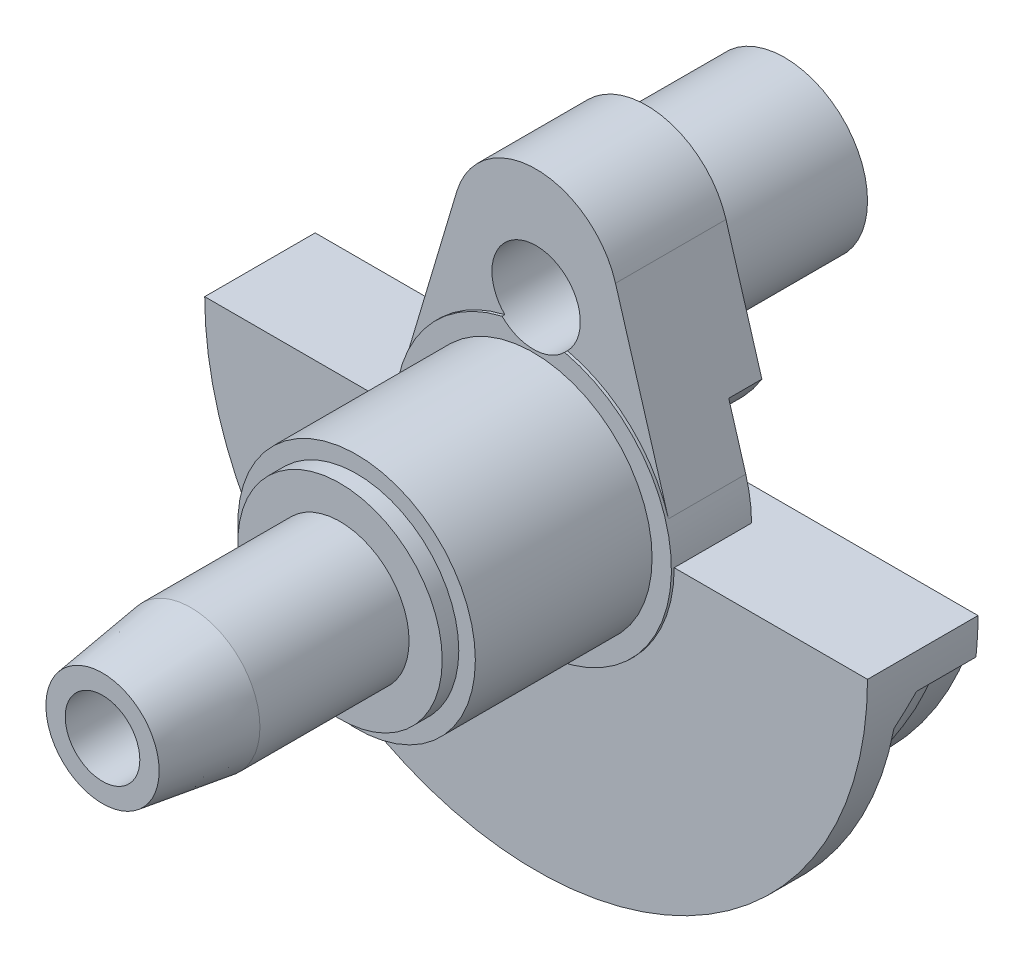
from build123d import *

# Parameters (mm, degrees)
BOSS_EXTRUDE1_DEPTH      = 1
BOSS_EXTRUDE1_DEPTH_BACK = 40
SKETCH1_R                = 50
BOSS_EXTRUDE2_DEPTH      = 40
SKETCH3_R                = 25
BOSS_EXTRUDE3_DEPTH      = 32
BOSS_EXTRUDE3_TAPER      = 8
SKETCH4_R                = 30
BOSS_EXTRUDE4_DEPTH      = 50
SKETCH5_R                = 21
CUT_EXTRUDE1_DEPTH       = 25
CUT_EXTRUDE2_REACH       = 281.435
SKETCH6_R                = 11
CUT_EXTRUDE3_START       = -41
SKETCH7_R                = 16
CUT_EXTRUDE3_DEPTH       = 41
SKETCH8_R                = 13.50269329
CUT_EXTRUDE4_DEPTH       = 30
CUT_REVOLVE1_ANGLE       = 140
CUT_EXTRUDE5_DEPTH       = 12


with BuildPart() as part:
    # Sketch1 → Boss-Extrude1 (new, two sides: drawn at the far end of the back side and taken through both)
    with BuildSketch(Plane.XY.offset(-BOSS_EXTRUDE1_DEPTH_BACK)):
        Circle(SKETCH1_R)
    extrude(amount=BOSS_EXTRUDE1_DEPTH + BOSS_EXTRUDE1_DEPTH_BACK)

    # Sketch1_3 → Boss-Extrude2 (add)
    with BuildSketch(Plane.XY):
        with BuildLine():
            ThreePointArc((50, 0), (0, -50), (-50, 0))
            Line((-50, 0), (-120, 0))
            ThreePointArc((-120, 0), (0, -120), (120, 0))
            Line((120, 0), (50, 0))
        make_face()
        with BuildLine():
            ThreePointArc((28.749445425, 78.571428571), (0, 100), (-28.749445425, 78.571428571))
            Line((-28.749445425, 78.571428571), (-47.915742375, 14.285714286))
            ThreePointArc((-47.915742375, 14.285714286), (0, 50), (47.915742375, 14.285714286))
            Line((47.915742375, 14.285714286), (28.749445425, 78.571428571))
        make_face()
    extrude(amount=-BOSS_EXTRUDE2_DEPTH)

    # Sketch2 → Revolve1 (revolve)
    with BuildSketch(Plane(origin=(0, 0, 0), x_dir=(0, 0, -1), z_dir=(1, 0, 0)), mode=Mode.PRIVATE) as revolve1_sk:
        Polygon((-1, 0), (-1, 43), (-65, 43), (-65, 37), (-71, 37), (-71, 25), (-125, 25), (-125, 0), align=None)
    revolve(revolve1_sk.sketch.rotate(Axis((0, 0, 125), (0, 0, -1)), 90), axis=Axis((0, 0, 125), (0, 0, -1)))

    # Sketch3 → Boss-Extrude3 (add)
    with BuildSketch(Plane.XY.offset(125)):
        Circle(SKETCH3_R)
    extrude(amount=BOSS_EXTRUDE3_DEPTH, taper=BOSS_EXTRUDE3_TAPER)

    # Sketch4 → Boss-Extrude4 (add)
    with BuildSketch(Plane(origin=(0, 0, -40), x_dir=(-1, 0, 0), z_dir=(0, 0, -1))):
        with Locations(Location((0, 60, 0), (0, 0, 180))):
            Circle(SKETCH4_R)
    extrude(amount=BOSS_EXTRUDE4_DEPTH)

    # Sketch5 → Cut-Extrude1 (cut)
    with BuildSketch(Plane(origin=(0, 0, -90), x_dir=(-1, 0, 0), z_dir=(0, 0, -1))):
        with Locations((0, 60)):
            Circle(SKETCH5_R)
    extrude(amount=-CUT_EXTRUDE1_DEPTH, mode=Mode.SUBTRACT)

    # Cut-Extrude2: up to this face of the body (flat: up to its plane)
    cut_extrude2_end = Plane(part.part.faces().sort_by_distance((-48.585786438, 0, 1))[0])
    # Sketch6 → Cut-Extrude2 (cut, up to the picked face)
    with BuildSketch(Plane(origin=(0, 0, -65), x_dir=(-1, 0, 0), z_dir=(0, 0, -1)), mode=Mode.PRIVATE) as cut_extrude2_sk1:
        with Locations((0, 60)):
            Circle(SKETCH6_R)
    cut_extrude2_tool1 = split(extrude(cut_extrude2_sk1.sketch, amount=-CUT_EXTRUDE2_REACH, mode=Mode.PRIVATE), bisect_by=cut_extrude2_end, keep=Keep.BOTH, mode=Mode.PRIVATE)
    add(cut_extrude2_tool1.solids().sort_by(Axis((0, 60, -65), (0, 0, 1)))[0], mode=Mode.SUBTRACT)

    # Sketch7 → Cut-Extrude3 (cut)
    with BuildSketch(Plane(origin=(0, 0, -40), x_dir=(-1, 0, 0), z_dir=(0, 0, -1)).offset(CUT_EXTRUDE3_START)):
        with Locations((0, 60)):
            Circle(SKETCH7_R)
    extrude(amount=CUT_EXTRUDE3_DEPTH, mode=Mode.SUBTRACT)

    # Sketch8 → Cut-Extrude4 (cut)
    with BuildSketch(Plane.XY.offset(157)):
        Circle(SKETCH8_R)
    extrude(amount=-CUT_EXTRUDE4_DEPTH, mode=Mode.SUBTRACT)

    # Sketch9 → Cut-Revolve1 (revolve, symmetric, cut)
    with BuildSketch(Plane(origin=(0, 0, 0), x_dir=(0, 0, -1), z_dir=(1, 0, 0))) as cut_revolve1_sk:
        Polygon((40, -120), (40, -94), (28, -94), (11.645736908, -99), (11.645736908, -120), align=None)
    revolve(axis=Axis((0, 30, -40), (0, 0, -1)), revolution_arc=CUT_REVOLVE1_ANGLE / 2, mode=Mode.SUBTRACT)
    revolve(cut_revolve1_sk.sketch, axis=Axis((0, 30, -40), (0, 0, 1)), revolution_arc=CUT_REVOLVE1_ANGLE / 2, mode=Mode.SUBTRACT)

    # Sketch10 → Cut-Extrude5 (cut)
    with BuildSketch(Plane(origin=(0, 0, -40), x_dir=(-1, 0, 0), z_dir=(0, 0, -1))):
        with BuildLine():
            Line((-41.73993558, 35), (-47.915742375, 14.285714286))
            ThreePointArc((-47.915742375, 14.285714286), (-49.476191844, 7.218479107), (-50, 0))
            Line((-50, 0), (50, 0))
            ThreePointArc((50, 0), (49.476191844, 7.218479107), (47.915742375, 14.285714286))
            Line((47.915742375, 14.285714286), (41.73993558, 35))
            ThreePointArc((41.73993558, 35), (0, 11.345892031), (-41.73993558, 35))
        make_face()
    extrude(amount=-CUT_EXTRUDE5_DEPTH, mode=Mode.SUBTRACT)


solid = part.part
